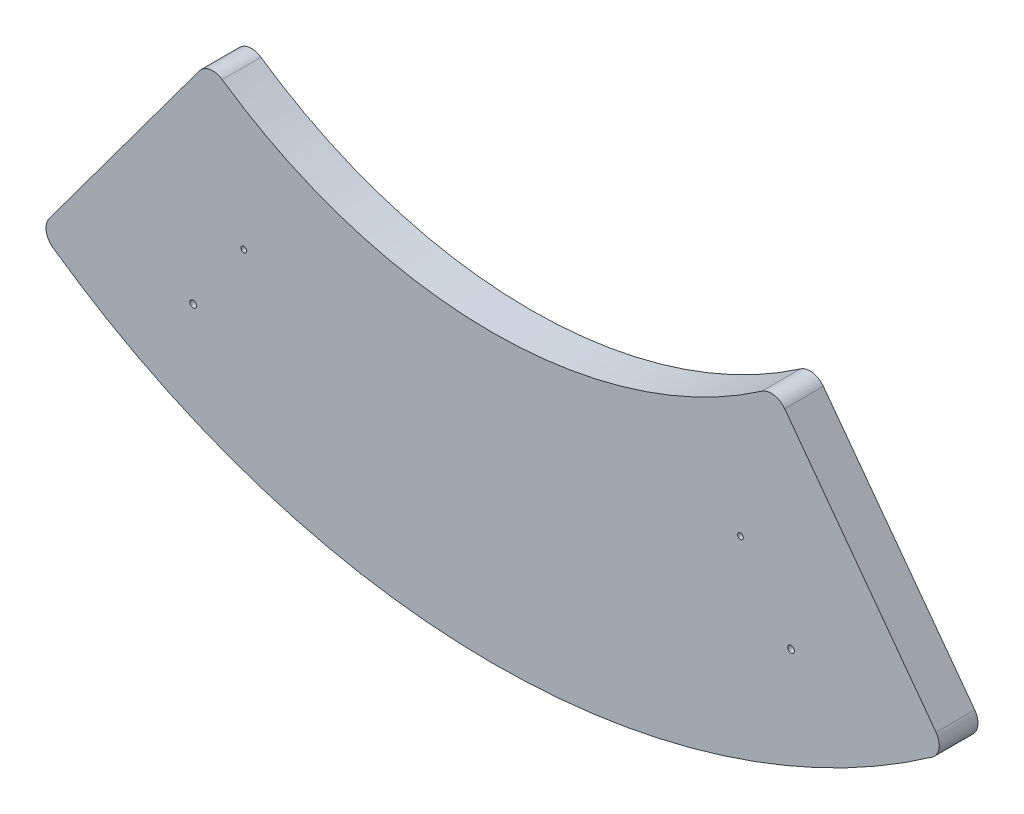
from build123d import *

# Parameters (mm, degrees)
ESQUISSE1_R             = 2.6
EXTRUSION1_DEPTH        = 35
CONG_1_R                = 15
ESQUISSE2_R             = 3
ENL_V_MAT_EXTRU_1_DEPTH = 769.240303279


with BuildPart() as part:
    # Esquisse1 → Extrusion1 (new body)
    with BuildSketch(Plane.XY):
        with BuildLine():
            Line((-256.957300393, -308.996140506), (-410.532542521, -516.541168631))
            ThreePointArc((-410.532542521, -516.541168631), (-0.884116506, -652.210391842), (409.244220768, -517.998924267))
            Line((409.244220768, -517.998924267), (254.590296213, -308.996140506))
            ThreePointArc((254.590296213, -308.996140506), (-1.18350209, -393.337690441), (-256.957300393, -308.996140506))
        make_face()
        with Locations((-225.628933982, -440.651454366)):
            Circle(ESQUISSE1_R, mode=Mode.SUBTRACT)
        with Locations((223.371366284, -440.651454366)):
            Circle(ESQUISSE1_R, mode=Mode.SUBTRACT)
    extrude(amount=EXTRUSION1_DEPTH)

    # Cong_1
    cong_1_edges = [part.edges().sort_by_distance(p)[0] for p in [
        (254.590296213, -308.996140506, 17.5),
        (409.244220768, -517.998924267, 17.5),
        (-410.532542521, -516.541168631, 17.5),
        (-256.957300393, -308.996140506, 17.5),
    ]]
    fillet(cong_1_edges, radius=CONG_1_R)

    # Esquisse2 → Enl_v. mat.-Extru.1 (cut, through all)
    with BuildSketch(Plane.XY.offset(35)):
        with Locations((-271.388064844, -506.272349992)):
            Circle(ESQUISSE2_R)
        with Locations((269.130497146, -506.272349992)):
            Circle(ESQUISSE2_R)
    extrude(amount=-ENL_V_MAT_EXTRU_1_DEPTH, mode=Mode.SUBTRACT)


solid = part.part
